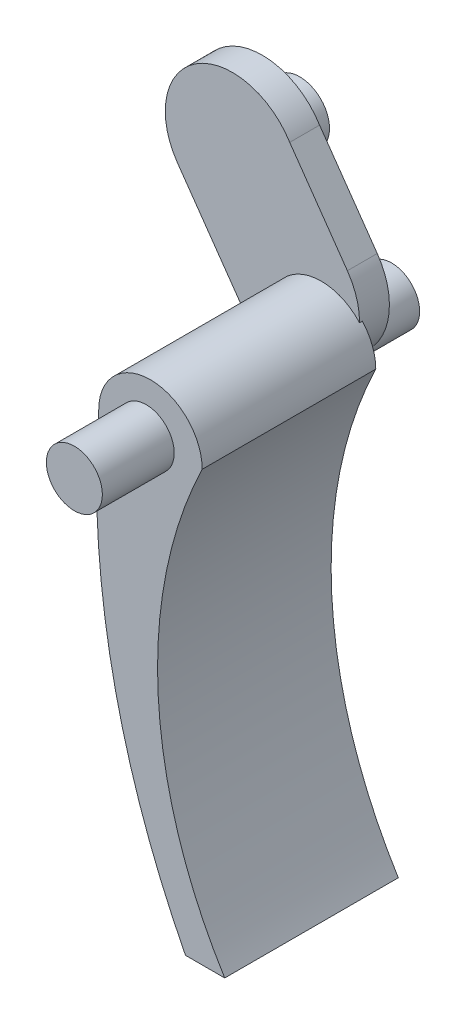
ISO-10303-21;
HEADER;
FILE_DESCRIPTION(('STEP AP214'),'2;1');
FILE_NAME('part.step','',(''),(''),'','','');
FILE_SCHEMA(('AUTOMOTIVE_DESIGN { 1 0 10303 214 1 1 1 1 }'));
ENDSEC;
DATA;
#1=APPLICATION_CONTEXT('core data for automotive mechanical design processes');
#2=APPLICATION_PROTOCOL_DEFINITION('international standard','automotive_design',2000,#1);
#3=PRODUCT_CONTEXT('',#1,'mechanical');
#4=PRODUCT('Part','Part','',(#3));
#5=PRODUCT_RELATED_PRODUCT_CATEGORY('part','',(#4));
#6=PRODUCT_DEFINITION_FORMATION('','',#4);
#7=PRODUCT_DEFINITION_CONTEXT('part definition',#1,'design');
#8=PRODUCT_DEFINITION('design','',#6,#7);
#9=PRODUCT_DEFINITION_SHAPE('','',#8);
#10=(LENGTH_UNIT() NAMED_UNIT(*) SI_UNIT(.MILLI.,.METRE.));
#11=(NAMED_UNIT(*) PLANE_ANGLE_UNIT() SI_UNIT($,.RADIAN.));
#12=(NAMED_UNIT(*) SI_UNIT($,.STERADIAN.) SOLID_ANGLE_UNIT());
#13=UNCERTAINTY_MEASURE_WITH_UNIT(LENGTH_MEASURE(1.E-05),#10,'distance_accuracy_value','');
#14=(GEOMETRIC_REPRESENTATION_CONTEXT(3) GLOBAL_UNCERTAINTY_ASSIGNED_CONTEXT((#13)) GLOBAL_UNIT_ASSIGNED_CONTEXT((#10,
#11,#12)) REPRESENTATION_CONTEXT('',''));
#15=CARTESIAN_POINT('',(0.,0.,0.));
#16=DIRECTION('',(0.,0.,1.));
#17=DIRECTION('',(1.,0.,0.));
#18=AXIS2_PLACEMENT_3D('',#15,#16,#17);
#19=CARTESIAN_POINT('',(0.,0.,8.5));
#20=DIRECTION('',(0.,0.,-1.));
#21=DIRECTION('',(-1.,0.,0.));
#22=AXIS2_PLACEMENT_3D('',#19,#20,#21);
#23=CYLINDRICAL_SURFACE('',#22,1.5);
#24=CARTESIAN_POINT('',(0.,0.,8.5));
#25=DIRECTION('',(0.,0.,1.));
#26=DIRECTION('',(1.,0.,0.));
#27=AXIS2_PLACEMENT_3D('',#24,#25,#26);
#28=CIRCLE('',#27,1.5);
#29=CARTESIAN_POINT('',(1.5,0.,8.5));
#30=VERTEX_POINT('',#29);
#31=EDGE_CURVE('E219',#30,#30,#28,.T.);
#32=ORIENTED_EDGE('',*,*,#31,.F.);
#33=EDGE_LOOP('',(#32));
#34=FACE_BOUND('',#33,.T.);
#35=CARTESIAN_POINT('',(0.,0.,4.65));
#36=DIRECTION('',(0.,0.,-1.));
#37=DIRECTION('',(-1.,0.,0.));
#38=AXIS2_PLACEMENT_3D('',#35,#36,#37);
#39=CIRCLE('',#38,1.5);
#40=CARTESIAN_POINT('',(-1.5,0.,4.65));
#41=VERTEX_POINT('',#40);
#42=EDGE_CURVE('E11',#41,#41,#39,.T.);
#43=ORIENTED_EDGE('',*,*,#42,.F.);
#44=EDGE_LOOP('',(#43));
#45=FACE_BOUND('',#44,.T.);
#46=ADVANCED_FACE('F39',(#34,#45),#23,.T.);
#47=CARTESIAN_POINT('',(0.,0.,8.5));
#48=DIRECTION('',(0.,0.,1.));
#49=DIRECTION('',(1.,0.,0.));
#50=AXIS2_PLACEMENT_3D('',#47,#48,#49);
#51=PLANE('',#50);
#52=ORIENTED_EDGE('',*,*,#31,.T.);
#53=EDGE_LOOP('',(#52));
#54=FACE_BOUND('',#53,.T.);
#55=ADVANCED_FACE('F333',(#54),#51,.T.);
#56=CARTESIAN_POINT('',(0.228356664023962,0.,4.65));
#57=DIRECTION('',(0.,0.,-1.));
#58=DIRECTION('',(-1.,0.,0.));
#59=AXIS2_PLACEMENT_3D('',#56,#57,#58);
#60=CYLINDRICAL_SURFACE('',#59,2.77164333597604);
#61=CARTESIAN_POINT('',(0.228356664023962,0.,-4.65));
#62=DIRECTION('',(0.,0.,1.));
#63=DIRECTION('',(-1.,0.,0.));
#64=AXIS2_PLACEMENT_3D('',#61,#62,#63);
#65=CIRCLE('',#64,2.77164333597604);
#66=CARTESIAN_POINT('',(3.,0.,-4.65));
#67=VERTEX_POINT('',#66);
#68=CARTESIAN_POINT('',(2.28008108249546,1.86344672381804,-4.65));
#69=VERTEX_POINT('',#68);
#70=EDGE_CURVE('E260',#67,#69,#65,.T.);
#71=ORIENTED_EDGE('',*,*,#70,.T.);
#72=DIRECTION('',(0.,0.,-1.));
#73=VECTOR('',#72,1.);
#74=CARTESIAN_POINT('',(2.28008108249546,1.86344672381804,-4.575));
#75=LINE('',#74,#73);
#76=CARTESIAN_POINT('',(2.28008108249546,1.86344672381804,-4.5));
#77=VERTEX_POINT('',#76);
#78=EDGE_CURVE('E55',#69,#77,#75,.F.);
#79=ORIENTED_EDGE('',*,*,#78,.T.);
#80=CARTESIAN_POINT('',(0.228356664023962,0.,-4.5));
#81=DIRECTION('',(0.,0.,-1.));
#82=DIRECTION('',(-1.,0.,0.));
#83=AXIS2_PLACEMENT_3D('',#80,#81,#82);
#84=CIRCLE('',#83,2.77164333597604);
#85=CARTESIAN_POINT('',(-2.54328667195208,0.,-4.5));
#86=VERTEX_POINT('',#85);
#87=EDGE_CURVE('E241',#77,#86,#84,.F.);
#88=ORIENTED_EDGE('',*,*,#87,.T.);
#89=DIRECTION('',(0.,0.,-1.));
#90=VECTOR('',#89,1.);
#91=CARTESIAN_POINT('',(-2.54328667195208,0.,4.65));
#92=LINE('',#91,#90);
#93=CARTESIAN_POINT('',(-2.54328667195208,0.,4.65));
#94=VERTEX_POINT('',#93);
#95=EDGE_CURVE('E137',#94,#86,#92,.T.);
#96=ORIENTED_EDGE('',*,*,#95,.F.);
#97=CARTESIAN_POINT('',(0.228356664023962,0.,4.65));
#98=DIRECTION('',(0.,0.,1.));
#99=DIRECTION('',(-1.,0.,0.));
#100=AXIS2_PLACEMENT_3D('',#97,#98,#99);
#101=CIRCLE('',#100,2.77164333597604);
#102=CARTESIAN_POINT('',(3.,0.,4.65));
#103=VERTEX_POINT('',#102);
#104=EDGE_CURVE('E128',#103,#94,#101,.T.);
#105=ORIENTED_EDGE('',*,*,#104,.F.);
#106=DIRECTION('',(0.,0.,-1.));
#107=VECTOR('',#106,1.);
#108=CARTESIAN_POINT('',(3.,0.,4.65));
#109=LINE('',#108,#107);
#110=EDGE_CURVE('E133',#103,#67,#109,.T.);
#111=ORIENTED_EDGE('',*,*,#110,.T.);
#112=EDGE_LOOP('',(#71,#79,#88,#96,#105,#111));
#113=FACE_BOUND('',#112,.T.);
#114=ADVANCED_FACE('F131',(#113),#60,.T.);
#115=CARTESIAN_POINT('',(40.6399925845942,-3.24514566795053,4.65));
#116=DIRECTION('',(0.,0.,-1.));
#117=DIRECTION('',(-1.,0.,0.));
#118=AXIS2_PLACEMENT_3D('',#115,#116,#117);
#119=CYLINDRICAL_SURFACE('',#118,43.3050410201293);
#120=CARTESIAN_POINT('',(40.6399925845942,-3.24514566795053,-4.5));
#121=DIRECTION('',(0.,0.,-1.));
#122=DIRECTION('',(-1.,0.,0.));
#123=AXIS2_PLACEMENT_3D('',#120,#121,#122);
#124=CIRCLE('',#123,43.3050410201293);
#125=CARTESIAN_POINT('',(-2.62860094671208,-1.46880347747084,-4.5));
#126=VERTEX_POINT('',#125);
#127=EDGE_CURVE('E237',#86,#126,#124,.F.);
#128=ORIENTED_EDGE('',*,*,#127,.T.);
#129=DIRECTION('',(0.,0.,-1.));
#130=VECTOR('',#129,1.);
#131=CARTESIAN_POINT('',(-2.62860094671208,-1.46880347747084,0.));
#132=LINE('',#131,#130);
#133=CARTESIAN_POINT('',(-2.62860094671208,-1.46880347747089,-4.65));
#134=VERTEX_POINT('',#133);
#135=EDGE_CURVE('E158',#126,#134,#132,.T.);
#136=ORIENTED_EDGE('',*,*,#135,.T.);
#137=CARTESIAN_POINT('',(40.6399925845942,-3.24514566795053,-4.65));
#138=DIRECTION('',(0.,0.,1.));
#139=DIRECTION('',(-1.,0.,0.));
#140=AXIS2_PLACEMENT_3D('',#137,#138,#139);
#141=CIRCLE('',#140,43.3050410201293);
#142=CARTESIAN_POINT('',(2.10335666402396,-23.,-4.65));
#143=VERTEX_POINT('',#142);
#144=EDGE_CURVE('E255',#134,#143,#141,.T.);
#145=ORIENTED_EDGE('',*,*,#144,.T.);
#146=DIRECTION('',(0.,0.,-1.));
#147=VECTOR('',#146,1.);
#148=CARTESIAN_POINT('',(2.10335666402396,-23.,4.65));
#149=LINE('',#148,#147);
#150=CARTESIAN_POINT('',(2.10335666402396,-23.,4.65));
#151=VERTEX_POINT('',#150);
#152=EDGE_CURVE('E164',#151,#143,#149,.T.);
#153=ORIENTED_EDGE('',*,*,#152,.F.);
#154=CARTESIAN_POINT('',(40.6399925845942,-3.24514566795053,4.65));
#155=DIRECTION('',(0.,0.,1.));
#156=DIRECTION('',(-1.,0.,0.));
#157=AXIS2_PLACEMENT_3D('',#154,#155,#156);
#158=CIRCLE('',#157,43.3050410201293);
#159=EDGE_CURVE('E141',#94,#151,#158,.T.);
#160=ORIENTED_EDGE('',*,*,#159,.F.);
#161=ORIENTED_EDGE('',*,*,#95,.T.);
#162=EDGE_LOOP('',(#128,#136,#145,#153,#160,#161));
#163=FACE_BOUND('',#162,.T.);
#164=ADVANCED_FACE('F253',(#163),#119,.T.);
#165=CARTESIAN_POINT('',(24.4427410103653,-10.4066450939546,4.65));
#166=DIRECTION('',(0.,0.,-1.));
#167=DIRECTION('',(-1.,0.,0.));
#168=AXIS2_PLACEMENT_3D('',#165,#166,#167);
#169=CYLINDRICAL_SURFACE('',#168,23.8346261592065);
#170=CARTESIAN_POINT('',(24.4427410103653,-10.4066450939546,-4.65));
#171=DIRECTION('',(0.,0.,-1.));
#172=DIRECTION('',(-1.,0.,0.));
#173=AXIS2_PLACEMENT_3D('',#170,#171,#172);
#174=CIRCLE('',#173,23.8346261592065);
#175=CARTESIAN_POINT('',(4.20671332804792,-23.,-4.65));
#176=VERTEX_POINT('',#175);
#177=EDGE_CURVE('E156',#176,#67,#174,.T.);
#178=ORIENTED_EDGE('',*,*,#177,.T.);
#179=ORIENTED_EDGE('',*,*,#110,.F.);
#180=CARTESIAN_POINT('',(24.4427410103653,-10.4066450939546,4.65));
#181=DIRECTION('',(0.,0.,-1.));
#182=DIRECTION('',(-1.,0.,0.));
#183=AXIS2_PLACEMENT_3D('',#180,#181,#182);
#184=CIRCLE('',#183,23.8346261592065);
#185=CARTESIAN_POINT('',(4.20671332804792,-23.,4.65));
#186=VERTEX_POINT('',#185);
#187=EDGE_CURVE('E142',#186,#103,#184,.T.);
#188=ORIENTED_EDGE('',*,*,#187,.F.);
#189=DIRECTION('',(0.,0.,-1.));
#190=VECTOR('',#189,1.);
#191=CARTESIAN_POINT('',(4.20671332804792,-23.,4.65));
#192=LINE('',#191,#190);
#193=EDGE_CURVE('E268',#186,#176,#192,.T.);
#194=ORIENTED_EDGE('',*,*,#193,.T.);
#195=EDGE_LOOP('',(#178,#179,#188,#194));
#196=FACE_BOUND('',#195,.T.);
#197=ADVANCED_FACE('F154',(#196),#169,.F.);
#198=CARTESIAN_POINT('',(2.10335666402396,-23.,4.65));
#199=DIRECTION('',(0.,1.,0.));
#200=DIRECTION('',(0.,0.,1.));
#201=AXIS2_PLACEMENT_3D('',#198,#199,#200);
#202=PLANE('',#201);
#203=DIRECTION('',(1.,0.,0.));
#204=VECTOR('',#203,1.);
#205=CARTESIAN_POINT('',(2.10335666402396,-23.,-4.65));
#206=LINE('',#205,#204);
#207=EDGE_CURVE('E152',#143,#176,#206,.T.);
#208=ORIENTED_EDGE('',*,*,#207,.T.);
#209=ORIENTED_EDGE('',*,*,#193,.F.);
#210=DIRECTION('',(1.,0.,0.));
#211=VECTOR('',#210,1.);
#212=CARTESIAN_POINT('',(2.10335666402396,-23.,4.65));
#213=LINE('',#212,#211);
#214=EDGE_CURVE('E147',#151,#186,#213,.T.);
#215=ORIENTED_EDGE('',*,*,#214,.F.);
#216=ORIENTED_EDGE('',*,*,#152,.T.);
#217=EDGE_LOOP('',(#208,#209,#215,#216));
#218=FACE_BOUND('',#217,.T.);
#219=ADVANCED_FACE('F272',(#218),#202,.F.);
#220=CARTESIAN_POINT('',(24.4427410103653,-10.4066450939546,4.65));
#221=DIRECTION('',(0.,0.,-1.));
#222=DIRECTION('',(-1.,0.,0.));
#223=AXIS2_PLACEMENT_3D('',#220,#221,#222);
#224=PLANE('',#223);
#225=ORIENTED_EDGE('',*,*,#42,.T.);
#226=EDGE_LOOP('',(#225));
#227=FACE_BOUND('',#226,.T.);
#228=ORIENTED_EDGE('',*,*,#187,.T.);
#229=ORIENTED_EDGE('',*,*,#104,.T.);
#230=ORIENTED_EDGE('',*,*,#159,.T.);
#231=ORIENTED_EDGE('',*,*,#214,.T.);
#232=EDGE_LOOP('',(#228,#229,#230,#231));
#233=FACE_BOUND('',#232,.T.);
#234=ADVANCED_FACE('F145',(#227,#233),#224,.F.);
#235=CARTESIAN_POINT('',(24.4427410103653,-10.4066450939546,-4.65));
#236=DIRECTION('',(0.,0.,-1.));
#237=DIRECTION('',(-1.,0.,0.));
#238=AXIS2_PLACEMENT_3D('',#235,#236,#237);
#239=PLANE('',#238);
#240=CARTESIAN_POINT('',(-1.3214068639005,1.88716457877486,-4.65));
#241=DIRECTION('',(0.,0.,-1.));
#242=DIRECTION('',(-1.,0.,0.));
#243=AXIS2_PLACEMENT_3D('',#240,#241,#242);
#244=CIRCLE('',#243,3.60156604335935);
#245=CARTESIAN_POINT('',(1.43774833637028,-0.427644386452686,-4.65));
#246=VERTEX_POINT('',#245);
#247=EDGE_CURVE('E59',#69,#246,#244,.T.);
#248=ORIENTED_EDGE('',*,*,#247,.F.);
#249=ORIENTED_EDGE('',*,*,#70,.F.);
#250=ORIENTED_EDGE('',*,*,#177,.F.);
#251=ORIENTED_EDGE('',*,*,#207,.F.);
#252=ORIENTED_EDGE('',*,*,#144,.F.);
#253=CARTESIAN_POINT('',(-1.3214068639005,1.88716457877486,-4.65));
#254=DIRECTION('',(0.,0.,-1.));
#255=DIRECTION('',(-1.,0.,0.));
#256=AXIS2_PLACEMENT_3D('',#253,#254,#255);
#257=CIRCLE('',#256,3.60156604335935);
#258=CARTESIAN_POINT('',(-0.0898846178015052,-1.49730449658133,-4.65));
#259=VERTEX_POINT('',#258);
#260=EDGE_CURVE('E48',#259,#134,#257,.T.);
#261=ORIENTED_EDGE('',*,*,#260,.F.);
#262=CARTESIAN_POINT('',(0.,0.,-4.65));
#263=DIRECTION('',(0.,0.,-1.));
#264=DIRECTION('',(-1.,0.,0.));
#265=AXIS2_PLACEMENT_3D('',#262,#263,#264);
#266=CIRCLE('',#265,1.5);
#267=EDGE_CURVE('E170',#246,#259,#266,.T.);
#268=ORIENTED_EDGE('',*,*,#267,.F.);
#269=EDGE_LOOP('',(#248,#249,#250,#251,#252,#261,#268));
#270=FACE_BOUND('',#269,.T.);
#271=ADVANCED_FACE('F258',(#270),#239,.T.);
#272=CARTESIAN_POINT('',(0.,0.,-8.5));
#273=DIRECTION('',(0.,0.,1.));
#274=DIRECTION('',(1.,0.,0.));
#275=AXIS2_PLACEMENT_3D('',#272,#273,#274);
#276=PLANE('',#275);
#277=CARTESIAN_POINT('',(0.,0.,-8.5));
#278=DIRECTION('',(0.,0.,1.));
#279=DIRECTION('',(1.,0.,0.));
#280=AXIS2_PLACEMENT_3D('',#277,#278,#279);
#281=CIRCLE('',#280,1.5);
#282=CARTESIAN_POINT('',(1.5,0.,-8.5));
#283=VERTEX_POINT('',#282);
#284=EDGE_CURVE('E218',#283,#283,#281,.T.);
#285=ORIENTED_EDGE('',*,*,#284,.F.);
#286=EDGE_LOOP('',(#285));
#287=FACE_BOUND('',#286,.T.);
#288=ADVANCED_FACE('F296',(#287),#276,.F.);
#289=CARTESIAN_POINT('',(-1.3214068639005,1.88716457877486,-6.1));
#290=DIRECTION('',(0.,0.,-1.));
#291=DIRECTION('',(-1.,0.,0.));
#292=AXIS2_PLACEMENT_3D('',#289,#290,#291);
#293=PLANE('',#292);
#294=CARTESIAN_POINT('',(-4.52723340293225,6.47647823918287,-6.1));
#295=DIRECTION('',(0.,0.,-1.));
#296=DIRECTION('',(-1.,0.,0.));
#297=AXIS2_PLACEMENT_3D('',#294,#295,#296);
#298=CIRCLE('',#297,1.59999999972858);
#299=CARTESIAN_POINT('',(-6.12723340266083,6.47647823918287,-6.1));
#300=VERTEX_POINT('',#299);
#301=EDGE_CURVE('E281',#300,#300,#298,.T.);
#302=ORIENTED_EDGE('',*,*,#301,.F.);
#303=EDGE_LOOP('',(#302));
#304=FACE_BOUND('',#303,.T.);
#305=CARTESIAN_POINT('',(0.,0.,-6.1));
#306=DIRECTION('',(0.,0.,-1.));
#307=DIRECTION('',(-1.,0.,0.));
#308=AXIS2_PLACEMENT_3D('',#305,#306,#307);
#309=CIRCLE('',#308,1.5);
#310=CARTESIAN_POINT('',(-0.089884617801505,-1.49730449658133,-6.1));
#311=VERTEX_POINT('',#310);
#312=CARTESIAN_POINT('',(1.43774833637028,-0.427644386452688,-6.1));
#313=VERTEX_POINT('',#312);
#314=EDGE_CURVE('E233',#311,#313,#309,.T.);
#315=ORIENTED_EDGE('',*,*,#314,.F.);
#316=CARTESIAN_POINT('',(-1.3214068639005,1.88716457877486,-6.1));
#317=DIRECTION('',(0.,0.,-1.));
#318=DIRECTION('',(-1.,0.,0.));
#319=AXIS2_PLACEMENT_3D('',#316,#317,#318);
#320=CIRCLE('',#319,3.60156604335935);
#321=CARTESIAN_POINT('',(-4.38827895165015,-0.00110806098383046,-6.1));
#322=VERTEX_POINT('',#321);
#323=EDGE_CURVE('E181',#311,#322,#320,.T.);
#324=ORIENTED_EDGE('',*,*,#323,.T.);
#325=DIRECTION('',(-0.573576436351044,0.819152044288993,0.));
#326=VECTOR('',#325,1.);
#327=CARTESIAN_POINT('',(-4.38827895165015,-0.00110806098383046,-6.1));
#328=LINE('',#327,#326);
#329=CARTESIAN_POINT('',(-7.4774635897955,4.41070482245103,-6.1));
#330=VERTEX_POINT('',#329);
#331=EDGE_CURVE('E180',#322,#330,#328,.T.);
#332=ORIENTED_EDGE('',*,*,#331,.T.);
#333=CARTESIAN_POINT('',(-4.52723340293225,6.47647823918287,-6.1));
#334=DIRECTION('',(0.,0.,-1.));
#335=DIRECTION('',(1.,0.,0.));
#336=AXIS2_PLACEMENT_3D('',#333,#334,#335);
#337=CIRCLE('',#336,3.6015660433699);
#338=CARTESIAN_POINT('',(-1.46036131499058,8.36475087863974,-6.1));
#339=VERTEX_POINT('',#338);
#340=EDGE_CURVE('E184',#330,#339,#337,.T.);
#341=ORIENTED_EDGE('',*,*,#340,.T.);
#342=DIRECTION('',(0.573576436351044,-0.819152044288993,0.));
#343=VECTOR('',#342,1.);
#344=CARTESIAN_POINT('',(1.62882332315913,3.95293799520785,-6.1));
#345=LINE('',#344,#343);
#346=CARTESIAN_POINT('',(1.62882332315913,3.95293799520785,-6.1));
#347=VERTEX_POINT('',#346);
#348=EDGE_CURVE('E187',#339,#347,#345,.T.);
#349=ORIENTED_EDGE('',*,*,#348,.T.);
#350=EDGE_CURVE('E176',#347,#313,#320,.T.);
#351=ORIENTED_EDGE('',*,*,#350,.T.);
#352=EDGE_LOOP('',(#315,#324,#332,#341,#349,#351));
#353=FACE_BOUND('',#352,.T.);
#354=ADVANCED_FACE('F292',(#304,#353),#293,.T.);
#355=CARTESIAN_POINT('',(-4.38827895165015,-0.00110806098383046,-6.1));
#356=DIRECTION('',(0.819152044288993,0.573576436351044,0.));
#357=DIRECTION('',(-0.573576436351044,0.819152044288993,0.));
#358=AXIS2_PLACEMENT_3D('',#355,#356,#357);
#359=PLANE('',#358);
#360=DIRECTION('',(-0.573576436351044,0.819152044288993,0.));
#361=VECTOR('',#360,1.);
#362=CARTESIAN_POINT('',(-4.38827895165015,-0.00110806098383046,-4.5));
#363=LINE('',#362,#361);
#364=CARTESIAN_POINT('',(-4.38827895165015,-0.00110806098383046,-4.5));
#365=VERTEX_POINT('',#364);
#366=CARTESIAN_POINT('',(-7.4774635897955,4.41070482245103,-4.5));
#367=VERTEX_POINT('',#366);
#368=EDGE_CURVE('E194',#365,#367,#363,.T.);
#369=ORIENTED_EDGE('',*,*,#368,.T.);
#370=DIRECTION('',(0.,0.,1.));
#371=VECTOR('',#370,1.);
#372=CARTESIAN_POINT('',(-7.4774635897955,4.41070482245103,-6.1));
#373=LINE('',#372,#371);
#374=EDGE_CURVE('E210',#330,#367,#373,.T.);
#375=ORIENTED_EDGE('',*,*,#374,.F.);
#376=ORIENTED_EDGE('',*,*,#331,.F.);
#377=DIRECTION('',(0.,0.,1.));
#378=VECTOR('',#377,1.);
#379=CARTESIAN_POINT('',(-4.38827895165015,-0.00110806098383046,-6.1));
#380=LINE('',#379,#378);
#381=EDGE_CURVE('E214',#322,#365,#380,.T.);
#382=ORIENTED_EDGE('',*,*,#381,.T.);
#383=EDGE_LOOP('',(#369,#375,#376,#382));
#384=FACE_BOUND('',#383,.T.);
#385=ADVANCED_FACE('F295',(#384),#359,.F.);
#386=CARTESIAN_POINT('',(-4.52723340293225,6.47647823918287,-6.1));
#387=DIRECTION('',(0.,0.,1.));
#388=DIRECTION('',(1.,0.,0.));
#389=AXIS2_PLACEMENT_3D('',#386,#387,#388);
#390=CYLINDRICAL_SURFACE('',#389,3.6015660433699);
#391=CARTESIAN_POINT('',(-4.52723340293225,6.47647823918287,-4.5));
#392=DIRECTION('',(0.,0.,-1.));
#393=DIRECTION('',(1.,0.,0.));
#394=AXIS2_PLACEMENT_3D('',#391,#392,#393);
#395=CIRCLE('',#394,3.6015660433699);
#396=CARTESIAN_POINT('',(-1.46036131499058,8.36475087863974,-4.5));
#397=VERTEX_POINT('',#396);
#398=EDGE_CURVE('E197',#367,#397,#395,.T.);
#399=ORIENTED_EDGE('',*,*,#398,.T.);
#400=DIRECTION('',(0.,0.,1.));
#401=VECTOR('',#400,1.);
#402=CARTESIAN_POINT('',(-1.46036131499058,8.36475087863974,-6.1));
#403=LINE('',#402,#401);
#404=EDGE_CURVE('E206',#339,#397,#403,.T.);
#405=ORIENTED_EDGE('',*,*,#404,.F.);
#406=ORIENTED_EDGE('',*,*,#340,.F.);
#407=ORIENTED_EDGE('',*,*,#374,.T.);
#408=EDGE_LOOP('',(#399,#405,#406,#407));
#409=FACE_BOUND('',#408,.T.);
#410=ADVANCED_FACE('F317',(#409),#390,.T.);
#411=CARTESIAN_POINT('',(1.62882332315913,3.95293799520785,-6.1));
#412=DIRECTION('',(-0.819152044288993,-0.573576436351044,0.));
#413=DIRECTION('',(0.573576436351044,-0.819152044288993,0.));
#414=AXIS2_PLACEMENT_3D('',#411,#412,#413);
#415=PLANE('',#414);
#416=DIRECTION('',(0.573576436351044,-0.819152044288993,0.));
#417=VECTOR('',#416,1.);
#418=CARTESIAN_POINT('',(1.62882332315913,3.95293799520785,-4.5));
#419=LINE('',#418,#417);
#420=CARTESIAN_POINT('',(1.62882332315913,3.95293799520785,-4.5));
#421=VERTEX_POINT('',#420);
#422=EDGE_CURVE('E200',#397,#421,#419,.T.);
#423=ORIENTED_EDGE('',*,*,#422,.T.);
#424=DIRECTION('',(0.,0.,1.));
#425=VECTOR('',#424,1.);
#426=CARTESIAN_POINT('',(1.62882332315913,3.95293799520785,-6.1));
#427=LINE('',#426,#425);
#428=EDGE_CURVE('E190',#347,#421,#427,.T.);
#429=ORIENTED_EDGE('',*,*,#428,.F.);
#430=ORIENTED_EDGE('',*,*,#348,.F.);
#431=ORIENTED_EDGE('',*,*,#404,.T.);
#432=EDGE_LOOP('',(#423,#429,#430,#431));
#433=FACE_BOUND('',#432,.T.);
#434=ADVANCED_FACE('F319',(#433),#415,.F.);
#435=CARTESIAN_POINT('',(-1.3214068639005,1.88716457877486,-4.5));
#436=DIRECTION('',(0.,0.,-1.));
#437=DIRECTION('',(-1.,0.,0.));
#438=AXIS2_PLACEMENT_3D('',#435,#436,#437);
#439=PLANE('',#438);
#440=ORIENTED_EDGE('',*,*,#87,.F.);
#441=CARTESIAN_POINT('',(-1.3214068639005,1.88716457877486,-4.5));
#442=DIRECTION('',(0.,0.,-1.));
#443=DIRECTION('',(-1.,0.,0.));
#444=AXIS2_PLACEMENT_3D('',#441,#442,#443);
#445=CIRCLE('',#444,3.60156604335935);
#446=EDGE_CURVE('E191',#421,#77,#445,.T.);
#447=ORIENTED_EDGE('',*,*,#446,.F.);
#448=ORIENTED_EDGE('',*,*,#422,.F.);
#449=ORIENTED_EDGE('',*,*,#398,.F.);
#450=ORIENTED_EDGE('',*,*,#368,.F.);
#451=EDGE_CURVE('E175',#126,#365,#445,.T.);
#452=ORIENTED_EDGE('',*,*,#451,.F.);
#453=ORIENTED_EDGE('',*,*,#127,.F.);
#454=EDGE_LOOP('',(#440,#447,#448,#449,#450,#452,#453));
#455=FACE_BOUND('',#454,.T.);
#456=ADVANCED_FACE('F308',(#455),#439,.F.);
#457=CARTESIAN_POINT('',(-1.3214068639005,1.88716457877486,-6.1));
#458=DIRECTION('',(0.,0.,1.));
#459=DIRECTION('',(1.,0.,0.));
#460=AXIS2_PLACEMENT_3D('',#457,#458,#459);
#461=CYLINDRICAL_SURFACE('',#460,3.60156604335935);
#462=ORIENTED_EDGE('',*,*,#135,.F.);
#463=ORIENTED_EDGE('',*,*,#451,.T.);
#464=ORIENTED_EDGE('',*,*,#381,.F.);
#465=ORIENTED_EDGE('',*,*,#323,.F.);
#466=DIRECTION('',(0.,0.,1.));
#467=VECTOR('',#466,1.);
#468=CARTESIAN_POINT('',(-0.0898846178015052,-1.49730449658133,-5.3));
#469=LINE('',#468,#467);
#470=EDGE_CURVE('E223',#311,#259,#469,.T.);
#471=ORIENTED_EDGE('',*,*,#470,.T.);
#472=ORIENTED_EDGE('',*,*,#260,.T.);
#473=EDGE_LOOP('',(#462,#463,#464,#465,#471,#472));
#474=FACE_BOUND('',#473,.T.);
#475=ADVANCED_FACE('F247',(#474),#461,.T.);
#476=ORIENTED_EDGE('',*,*,#78,.F.);
#477=ORIENTED_EDGE('',*,*,#247,.T.);
#478=DIRECTION('',(0.,0.,1.));
#479=VECTOR('',#478,1.);
#480=CARTESIAN_POINT('',(1.43774833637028,-0.427644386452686,-5.3));
#481=LINE('',#480,#479);
#482=EDGE_CURVE('E230',#246,#313,#481,.F.);
#483=ORIENTED_EDGE('',*,*,#482,.T.);
#484=ORIENTED_EDGE('',*,*,#350,.F.);
#485=ORIENTED_EDGE('',*,*,#428,.T.);
#486=ORIENTED_EDGE('',*,*,#446,.T.);
#487=EDGE_LOOP('',(#476,#477,#483,#484,#485,#486));
#488=FACE_BOUND('',#487,.T.);
#489=ADVANCED_FACE('F321',(#488),#461,.T.);
#490=ORIENTED_EDGE('',*,*,#482,.F.);
#491=ORIENTED_EDGE('',*,*,#267,.T.);
#492=ORIENTED_EDGE('',*,*,#470,.F.);
#493=ORIENTED_EDGE('',*,*,#314,.T.);
#494=EDGE_LOOP('',(#490,#491,#492,#493));
#495=FACE_BOUND('',#494,.T.);
#496=ORIENTED_EDGE('',*,*,#284,.T.);
#497=EDGE_LOOP('',(#496));
#498=FACE_BOUND('',#497,.T.);
#499=ADVANCED_FACE('F41',(#495,#498),#23,.T.);
#500=CARTESIAN_POINT('',(-4.52723340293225,6.47647823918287,-8.1));
#501=DIRECTION('',(0.,0.,1.));
#502=DIRECTION('',(1.,0.,0.));
#503=AXIS2_PLACEMENT_3D('',#500,#501,#502);
#504=CYLINDRICAL_SURFACE('',#503,1.59999999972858);
#505=CARTESIAN_POINT('',(-4.52723340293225,6.47647823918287,-8.1));
#506=DIRECTION('',(0.,0.,-1.));
#507=DIRECTION('',(-1.,0.,0.));
#508=AXIS2_PLACEMENT_3D('',#505,#506,#507);
#509=CIRCLE('',#508,1.59999999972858);
#510=CARTESIAN_POINT('',(-6.12723340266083,6.47647823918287,-8.1));
#511=VERTEX_POINT('',#510);
#512=EDGE_CURVE('E278',#511,#511,#509,.T.);
#513=ORIENTED_EDGE('',*,*,#512,.F.);
#514=EDGE_LOOP('',(#513));
#515=FACE_BOUND('',#514,.T.);
#516=ORIENTED_EDGE('',*,*,#301,.T.);
#517=EDGE_LOOP('',(#516));
#518=FACE_BOUND('',#517,.T.);
#519=ADVANCED_FACE('F290',(#515,#518),#504,.T.);
#520=CARTESIAN_POINT('',(-4.52723340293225,6.47647823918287,-8.1));
#521=DIRECTION('',(0.,0.,-1.));
#522=DIRECTION('',(-1.,0.,0.));
#523=AXIS2_PLACEMENT_3D('',#520,#521,#522);
#524=PLANE('',#523);
#525=ORIENTED_EDGE('',*,*,#512,.T.);
#526=EDGE_LOOP('',(#525));
#527=FACE_BOUND('',#526,.T.);
#528=ADVANCED_FACE('F406',(#527),#524,.T.);
#529=CLOSED_SHELL('',(#46,#55,#114,#164,#197,#219,#234,#271,#288,#354,#385,#410,#434,#456,#475,
#489,#499,#519,#528));
#530=MANIFOLD_SOLID_BREP('B2',#529);
#531=ADVANCED_BREP_SHAPE_REPRESENTATION('',(#18,#530),#14);
#532=SHAPE_DEFINITION_REPRESENTATION(#9,#531);
ENDSEC;
END-ISO-10303-21;
